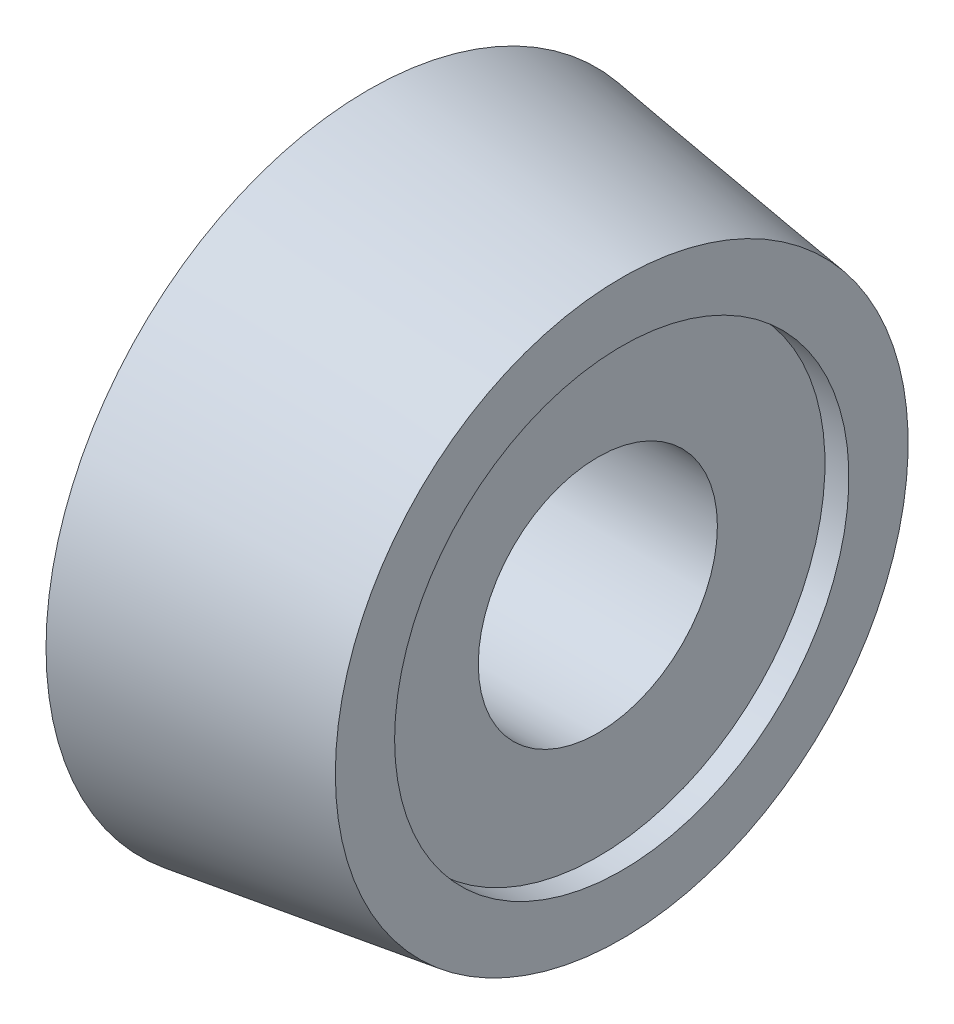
ISO-10303-21;
HEADER;
FILE_DESCRIPTION(('STEP AP214'),'2;1');
FILE_NAME('part.step','',(''),(''),'','','');
FILE_SCHEMA(('AUTOMOTIVE_DESIGN { 1 0 10303 214 1 1 1 1 }'));
ENDSEC;
DATA;
#1=APPLICATION_CONTEXT('core data for automotive mechanical design processes');
#2=APPLICATION_PROTOCOL_DEFINITION('international standard','automotive_design',2000,#1);
#3=PRODUCT_CONTEXT('',#1,'mechanical');
#4=PRODUCT('Part','Part','',(#3));
#5=PRODUCT_RELATED_PRODUCT_CATEGORY('part','',(#4));
#6=PRODUCT_DEFINITION_FORMATION('','',#4);
#7=PRODUCT_DEFINITION_CONTEXT('part definition',#1,'design');
#8=PRODUCT_DEFINITION('design','',#6,#7);
#9=PRODUCT_DEFINITION_SHAPE('','',#8);
#10=(LENGTH_UNIT() NAMED_UNIT(*) SI_UNIT(.MILLI.,.METRE.));
#11=(NAMED_UNIT(*) PLANE_ANGLE_UNIT() SI_UNIT($,.RADIAN.));
#12=(NAMED_UNIT(*) SI_UNIT($,.STERADIAN.) SOLID_ANGLE_UNIT());
#13=UNCERTAINTY_MEASURE_WITH_UNIT(LENGTH_MEASURE(1.E-05),#10,'distance_accuracy_value','');
#14=(GEOMETRIC_REPRESENTATION_CONTEXT(3) GLOBAL_UNCERTAINTY_ASSIGNED_CONTEXT((#13)) GLOBAL_UNIT_ASSIGNED_CONTEXT((#10,
#11,#12)) REPRESENTATION_CONTEXT('',''));
#15=CARTESIAN_POINT('',(0.,0.,0.));
#16=DIRECTION('',(0.,0.,1.));
#17=DIRECTION('',(1.,0.,0.));
#18=AXIS2_PLACEMENT_3D('',#15,#16,#17);
#19=CARTESIAN_POINT('',(-24.2501274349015,0.0107058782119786,0.));
#20=DIRECTION('',(-1.,0.,0.));
#21=DIRECTION('',(0.,0.,1.));
#22=AXIS2_PLACEMENT_3D('',#19,#20,#21);
#23=CYLINDRICAL_SURFACE('',#22,4.75);
#24=CARTESIAN_POINT('',(-18.4501274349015,0.0107058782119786,0.));
#25=DIRECTION('',(-1.,0.,0.));
#26=DIRECTION('',(0.,0.,1.));
#27=AXIS2_PLACEMENT_3D('',#24,#25,#26);
#28=CIRCLE('',#27,4.75);
#29=CARTESIAN_POINT('',(-18.4501274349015,0.0107058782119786,4.75));
#30=VERTEX_POINT('',#29);
#31=EDGE_CURVE('E11',#30,#30,#28,.T.);
#32=ORIENTED_EDGE('',*,*,#31,.F.);
#33=EDGE_LOOP('',(#32));
#34=FACE_BOUND('',#33,.T.);
#35=CARTESIAN_POINT('',(-18.9501274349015,0.0107058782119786,0.));
#36=DIRECTION('',(-1.,0.,0.));
#37=DIRECTION('',(0.,0.,1.));
#38=AXIS2_PLACEMENT_3D('',#35,#36,#37);
#39=CIRCLE('',#38,4.75);
#40=CARTESIAN_POINT('',(-18.9501274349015,0.0107058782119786,4.75));
#41=VERTEX_POINT('',#40);
#42=EDGE_CURVE('E80',#41,#41,#39,.T.);
#43=ORIENTED_EDGE('',*,*,#42,.T.);
#44=EDGE_LOOP('',(#43));
#45=FACE_BOUND('',#44,.T.);
#46=ADVANCED_FACE('F36',(#34,#45),#23,.F.);
#47=CARTESIAN_POINT('',(-18.4501274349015,6.00000000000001,0.));
#48=DIRECTION('',(-1.,0.,0.));
#49=DIRECTION('',(0.,0.,1.));
#50=AXIS2_PLACEMENT_3D('',#47,#48,#49);
#51=PLANE('',#50);
#52=CARTESIAN_POINT('',(-18.4501274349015,0.0107058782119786,0.));
#53=DIRECTION('',(-1.,0.,0.));
#54=DIRECTION('',(0.,0.,1.));
#55=AXIS2_PLACEMENT_3D('',#52,#53,#54);
#56=CIRCLE('',#55,5.98929412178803);
#57=CARTESIAN_POINT('',(-18.4501274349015,0.0107058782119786,5.98929412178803));
#58=VERTEX_POINT('',#57);
#59=EDGE_CURVE('E43',#58,#58,#56,.T.);
#60=ORIENTED_EDGE('',*,*,#59,.F.);
#61=EDGE_LOOP('',(#60));
#62=FACE_BOUND('',#61,.T.);
#63=ORIENTED_EDGE('',*,*,#31,.T.);
#64=EDGE_LOOP('',(#63));
#65=FACE_BOUND('',#64,.T.);
#66=ADVANCED_FACE('F88',(#62,#65),#51,.F.);
#67=CARTESIAN_POINT('',(-18.4501274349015,0.0107058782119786,0.));
#68=DIRECTION('',(-1.,0.,0.));
#69=DIRECTION('',(0.,0.,1.));
#70=AXIS2_PLACEMENT_3D('',#67,#68,#69);
#71=CONICAL_SURFACE('',#70,5.98929412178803,0.140576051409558);
#72=CARTESIAN_POINT('',(-23.7501274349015,0.0107058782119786,0.));
#73=DIRECTION('',(-1.,0.,0.));
#74=DIRECTION('',(0.,0.,1.));
#75=AXIS2_PLACEMENT_3D('',#72,#73,#74);
#76=CIRCLE('',#75,6.73929412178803);
#77=CARTESIAN_POINT('',(-23.7501274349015,0.0107058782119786,6.73929412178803));
#78=VERTEX_POINT('',#77);
#79=EDGE_CURVE('E75',#78,#78,#76,.T.);
#80=ORIENTED_EDGE('',*,*,#79,.F.);
#81=EDGE_LOOP('',(#80));
#82=FACE_BOUND('',#81,.T.);
#83=ORIENTED_EDGE('',*,*,#59,.T.);
#84=EDGE_LOOP('',(#83));
#85=FACE_BOUND('',#84,.T.);
#86=ADVANCED_FACE('F86',(#82,#85),#71,.T.);
#87=CARTESIAN_POINT('',(-23.7501274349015,4.50000000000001,0.));
#88=DIRECTION('',(1.,0.,0.));
#89=DIRECTION('',(0.,0.,-1.));
#90=AXIS2_PLACEMENT_3D('',#87,#88,#89);
#91=PLANE('',#90);
#92=CARTESIAN_POINT('',(-23.7501274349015,0.0107058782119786,0.));
#93=DIRECTION('',(-1.,0.,0.));
#94=DIRECTION('',(0.,0.,1.));
#95=AXIS2_PLACEMENT_3D('',#92,#93,#94);
#96=CIRCLE('',#95,4.48929412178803);
#97=CARTESIAN_POINT('',(-23.7501274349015,2.23416303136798,3.9));
#98=VERTEX_POINT('',#97);
#99=CARTESIAN_POINT('',(-23.7501274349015,-2.21275127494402,3.9));
#100=VERTEX_POINT('',#99);
#101=EDGE_CURVE('E72',#98,#100,#96,.T.);
#102=ORIENTED_EDGE('',*,*,#101,.F.);
#103=DIRECTION('',(0.,-1.,0.));
#104=VECTOR('',#103,1.);
#105=CARTESIAN_POINT('',(-23.7501274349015,0.,3.9));
#106=LINE('',#105,#104);
#107=EDGE_CURVE('E62',#98,#100,#106,.T.);
#108=ORIENTED_EDGE('',*,*,#107,.T.);
#109=EDGE_LOOP('',(#102,#108));
#110=FACE_BOUND('',#109,.T.);
#111=ORIENTED_EDGE('',*,*,#79,.T.);
#112=EDGE_LOOP('',(#111));
#113=FACE_BOUND('',#112,.T.);
#114=ADVANCED_FACE('F70',(#110,#113),#91,.F.);
#115=CARTESIAN_POINT('',(-24.2501274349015,0.0107058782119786,0.));
#116=DIRECTION('',(-1.,0.,0.));
#117=DIRECTION('',(0.,0.,1.));
#118=AXIS2_PLACEMENT_3D('',#115,#116,#117);
#119=CYLINDRICAL_SURFACE('',#118,4.48929412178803);
#120=ORIENTED_EDGE('',*,*,#101,.T.);
#121=DIRECTION('',(-1.,0.,0.));
#122=VECTOR('',#121,1.);
#123=CARTESIAN_POINT('',(-19.2643371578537,-2.21275127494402,3.9));
#124=LINE('',#123,#122);
#125=CARTESIAN_POINT('',(-24.2501274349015,-2.21275127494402,3.9));
#126=VERTEX_POINT('',#125);
#127=EDGE_CURVE('E59',#100,#126,#124,.T.);
#128=ORIENTED_EDGE('',*,*,#127,.T.);
#129=CARTESIAN_POINT('',(-24.2501274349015,0.0107058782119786,0.));
#130=DIRECTION('',(-1.,0.,0.));
#131=DIRECTION('',(0.,0.,1.));
#132=AXIS2_PLACEMENT_3D('',#129,#130,#131);
#133=CIRCLE('',#132,4.48929412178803);
#134=CARTESIAN_POINT('',(-24.2501274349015,2.23416303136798,3.9));
#135=VERTEX_POINT('',#134);
#136=EDGE_CURVE('E76',#135,#126,#133,.T.);
#137=ORIENTED_EDGE('',*,*,#136,.F.);
#138=DIRECTION('',(-1.,0.,0.));
#139=VECTOR('',#138,1.);
#140=CARTESIAN_POINT('',(-19.2643371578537,2.23416303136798,3.9));
#141=LINE('',#140,#139);
#142=EDGE_CURVE('E50',#98,#135,#141,.T.);
#143=ORIENTED_EDGE('',*,*,#142,.F.);
#144=EDGE_LOOP('',(#120,#128,#137,#143));
#145=FACE_BOUND('',#144,.T.);
#146=ADVANCED_FACE('F74',(#145),#119,.T.);
#147=CARTESIAN_POINT('',(-24.2501274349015,2.50000000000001,0.));
#148=DIRECTION('',(1.,0.,0.));
#149=DIRECTION('',(0.,0.,-1.));
#150=AXIS2_PLACEMENT_3D('',#147,#148,#149);
#151=PLANE('',#150);
#152=CARTESIAN_POINT('',(-24.2501274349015,0.,0.));
#153=DIRECTION('',(1.,0.,0.));
#154=DIRECTION('',(0.,0.,-1.));
#155=AXIS2_PLACEMENT_3D('',#152,#153,#154);
#156=CIRCLE('',#155,2.5);
#157=CARTESIAN_POINT('',(-24.2501274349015,0.,-2.5));
#158=VERTEX_POINT('',#157);
#159=EDGE_CURVE('E98',#158,#158,#156,.T.);
#160=ORIENTED_EDGE('',*,*,#159,.T.);
#161=EDGE_LOOP('',(#160));
#162=FACE_BOUND('',#161,.T.);
#163=ORIENTED_EDGE('',*,*,#136,.T.);
#164=DIRECTION('',(0.,-1.,0.));
#165=VECTOR('',#164,1.);
#166=CARTESIAN_POINT('',(-24.2501274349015,0.,3.9));
#167=LINE('',#166,#165);
#168=EDGE_CURVE('E55',#135,#126,#167,.T.);
#169=ORIENTED_EDGE('',*,*,#168,.F.);
#170=EDGE_LOOP('',(#163,#169));
#171=FACE_BOUND('',#170,.T.);
#172=ADVANCED_FACE('F112',(#162,#171),#151,.F.);
#173=CARTESIAN_POINT('',(-18.9501274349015,4.76070587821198,0.));
#174=DIRECTION('',(-1.,0.,0.));
#175=DIRECTION('',(0.,0.,1.));
#176=AXIS2_PLACEMENT_3D('',#173,#174,#175);
#177=PLANE('',#176);
#178=CARTESIAN_POINT('',(-18.9501274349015,0.,0.));
#179=DIRECTION('',(1.,0.,0.));
#180=DIRECTION('',(0.,0.,-1.));
#181=AXIS2_PLACEMENT_3D('',#178,#179,#180);
#182=CIRCLE('',#181,2.5);
#183=CARTESIAN_POINT('',(-18.9501274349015,0.,-2.5));
#184=VERTEX_POINT('',#183);
#185=EDGE_CURVE('E100',#184,#184,#182,.T.);
#186=ORIENTED_EDGE('',*,*,#185,.F.);
#187=EDGE_LOOP('',(#186));
#188=FACE_BOUND('',#187,.T.);
#189=ORIENTED_EDGE('',*,*,#42,.F.);
#190=EDGE_LOOP('',(#189));
#191=FACE_BOUND('',#190,.T.);
#192=ADVANCED_FACE('F110',(#188,#191),#177,.F.);
#193=CARTESIAN_POINT('',(-24.2501274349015,0.,0.));
#194=DIRECTION('',(1.,0.,0.));
#195=DIRECTION('',(0.,0.,-1.));
#196=AXIS2_PLACEMENT_3D('',#193,#194,#195);
#197=CYLINDRICAL_SURFACE('',#196,2.5);
#198=ORIENTED_EDGE('',*,*,#159,.F.);
#199=EDGE_LOOP('',(#198));
#200=FACE_BOUND('',#199,.T.);
#201=ORIENTED_EDGE('',*,*,#185,.T.);
#202=EDGE_LOOP('',(#201));
#203=FACE_BOUND('',#202,.T.);
#204=ADVANCED_FACE('F108',(#200,#203),#197,.F.);
#205=CARTESIAN_POINT('',(-19.2643371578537,0.,3.9));
#206=DIRECTION('',(0.,0.,-1.));
#207=DIRECTION('',(0.,1.,0.));
#208=AXIS2_PLACEMENT_3D('',#205,#206,#207);
#209=PLANE('',#208);
#210=ORIENTED_EDGE('',*,*,#142,.T.);
#211=ORIENTED_EDGE('',*,*,#168,.T.);
#212=ORIENTED_EDGE('',*,*,#127,.F.);
#213=ORIENTED_EDGE('',*,*,#107,.F.);
#214=EDGE_LOOP('',(#210,#211,#212,#213));
#215=FACE_BOUND('',#214,.T.);
#216=ADVANCED_FACE('F61',(#215),#209,.F.);
#217=CLOSED_SHELL('',(#46,#66,#86,#114,#146,#172,#192,#204,#216));
#218=MANIFOLD_SOLID_BREP('B2',#217);
#219=ADVANCED_BREP_SHAPE_REPRESENTATION('',(#18,#218),#14);
#220=SHAPE_DEFINITION_REPRESENTATION(#9,#219);
ENDSEC;
END-ISO-10303-21;
